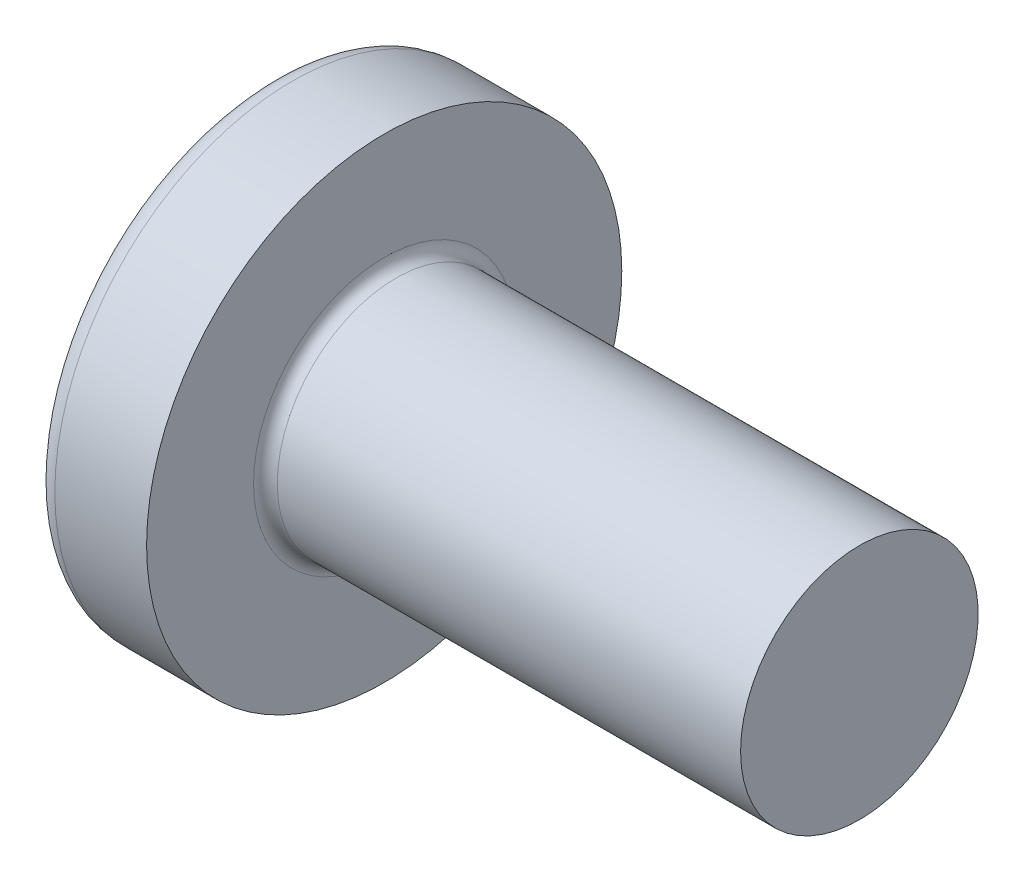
from build123d import *

# Parameters (mm, degrees)
FILLET1_R    = 0.2
RECPAT_COUNT = 2
RECPAT_ANGLE = 90


with BuildPart() as part:
    # BodySke → Base-Revolve (revolve)
    with BuildSketch(Plane.XY, mode=Mode.PRIVATE) as base_revolve_sk:
        with BuildLine():
            Line((3.1, 2), (3.1, 4))
            Line((3.1, 4), (1.555305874, 4))
            ThreePointArc((1.555305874, 4), (1.392873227, 3.961271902), (1.265388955, 3.853420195))
            ThreePointArc((1.265388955, 3.853420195), (0.324444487, 2.027933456), (0, 0))
            Line((0, 0), (11.1, 0))
            Line((11.1, 0), (11.1, 2))
            Line((11.1, 2), (3.1, 2))
        make_face()
    revolve(base_revolve_sk.sketch.rotate(Axis((1.555305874, 0, 0), (1, 0, 0)), 90), axis=Axis((1.555305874, 0, 0), (1, 0, 0)))

    # Fillet1
    fillet1_edges = [part.edges().sort_by_distance(p)[0] for p in [
        (3.1, 0, -2),
    ]]
    fillet(fillet1_edges, radius=FILLET1_R)

    # Sketch3 → Recess section 0
    with BuildSketch(Plane(origin=(0, 0, 0), x_dir=(0, 0, -1), z_dir=(1, 0, 0))):
        with BuildLine():
            Line((0.515, -2.15), (-0.515, -2.15))
            Line((-0.515, -2.15), (-0.515, 2.15))
            Line((-0.515, 2.15), (0.515, 2.15))
            Line((0.515, 2.15), (0.515, -2.15))
        make_face()
    # Sketch4 → Recess section 1
    with BuildSketch(Plane(origin=(2.34, 0, 0), x_dir=(0, 0, -1), z_dir=(1, 0, 0))):
        with BuildLine():
            Line((0.515, -0.983319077), (-0.515, -0.983319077))
            Line((-0.515, -0.983319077), (-0.515, 0.983319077))
            Line((-0.515, 0.983319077), (0.515, 0.983319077))
            Line((0.515, 0.983319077), (0.515, -0.983319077))
        make_face()
    recess = loft(mode=Mode.SUBTRACT)

    # RecPat: Recess ×2 about axis
    recpat_axis = Axis((0, 0, 0), (1, 0, 0))
    for i in range(1, RECPAT_COUNT):
        add(recess.rotate(recpat_axis, i * RECPAT_ANGLE / (RECPAT_COUNT - 1)), mode=Mode.SUBTRACT)

    # RecCorSke → RecessCore (revolve, cut)
    with BuildSketch(Plane.XY, mode=Mode.PRIVATE) as recesscore_sk:
        Polygon((0, 0), (0, 1.01462874), (2.34, 0.851), (2.616506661, 0), align=None)
    revolve(recesscore_sk.sketch.rotate(Axis((-3.175, 0, 0), (1, 0, 0)), 345.452408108), axis=Axis((-3.175, 0, 0), (1, 0, 0)), mode=Mode.SUBTRACT)


solid = part.part
